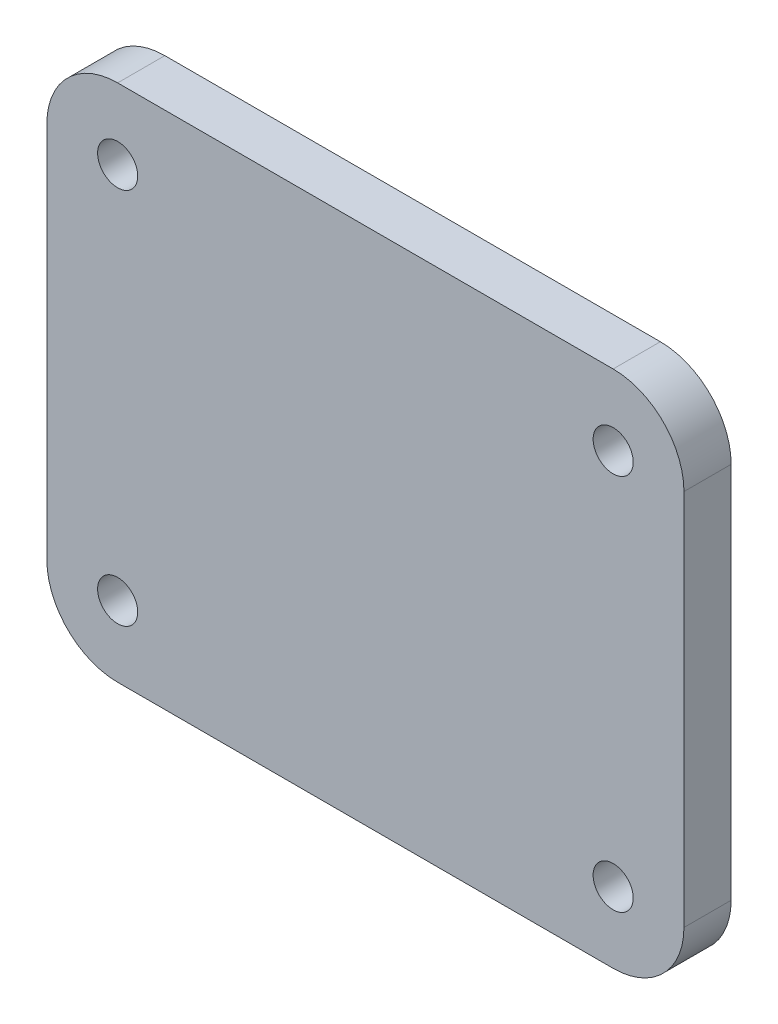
ISO-10303-21;
HEADER;
FILE_DESCRIPTION(('STEP AP214'),'2;1');
FILE_NAME('part.step','',(''),(''),'','','');
FILE_SCHEMA(('AUTOMOTIVE_DESIGN { 1 0 10303 214 1 1 1 1 }'));
ENDSEC;
DATA;
#1=APPLICATION_CONTEXT('core data for automotive mechanical design processes');
#2=APPLICATION_PROTOCOL_DEFINITION('international standard','automotive_design',2000,#1);
#3=PRODUCT_CONTEXT('',#1,'mechanical');
#4=PRODUCT('Part','Part','',(#3));
#5=PRODUCT_RELATED_PRODUCT_CATEGORY('part','',(#4));
#6=PRODUCT_DEFINITION_FORMATION('','',#4);
#7=PRODUCT_DEFINITION_CONTEXT('part definition',#1,'design');
#8=PRODUCT_DEFINITION('design','',#6,#7);
#9=PRODUCT_DEFINITION_SHAPE('','',#8);
#10=(LENGTH_UNIT() NAMED_UNIT(*) SI_UNIT(.MILLI.,.METRE.));
#11=(NAMED_UNIT(*) PLANE_ANGLE_UNIT() SI_UNIT($,.RADIAN.));
#12=(NAMED_UNIT(*) SI_UNIT($,.STERADIAN.) SOLID_ANGLE_UNIT());
#13=UNCERTAINTY_MEASURE_WITH_UNIT(LENGTH_MEASURE(1.E-05),#10,'distance_accuracy_value','');
#14=(GEOMETRIC_REPRESENTATION_CONTEXT(3) GLOBAL_UNCERTAINTY_ASSIGNED_CONTEXT((#13)) GLOBAL_UNIT_ASSIGNED_CONTEXT((#10,
#11,#12)) REPRESENTATION_CONTEXT('',''));
#15=CARTESIAN_POINT('',(0.,0.,0.));
#16=DIRECTION('',(0.,0.,1.));
#17=DIRECTION('',(1.,0.,0.));
#18=AXIS2_PLACEMENT_3D('',#15,#16,#17);
#19=CARTESIAN_POINT('',(-67.5,55.,10.));
#20=DIRECTION('',(1.,0.,0.));
#21=DIRECTION('',(0.,0.,-1.));
#22=AXIS2_PLACEMENT_3D('',#19,#20,#21);
#23=PLANE('',#22);
#24=DIRECTION('',(0.,-1.,0.));
#25=VECTOR('',#24,1.);
#26=CARTESIAN_POINT('',(-67.5,55.,0.));
#27=LINE('',#26,#25);
#28=CARTESIAN_POINT('',(-67.5,40.,0.));
#29=VERTEX_POINT('',#28);
#30=CARTESIAN_POINT('',(-67.5,-40.,0.));
#31=VERTEX_POINT('',#30);
#32=EDGE_CURVE('E132',#29,#31,#27,.T.);
#33=ORIENTED_EDGE('',*,*,#32,.T.);
#34=DIRECTION('',(0.,0.,-1.));
#35=VECTOR('',#34,1.);
#36=CARTESIAN_POINT('',(-67.5,-40.,10.));
#37=LINE('',#36,#35);
#38=CARTESIAN_POINT('',(-67.5,-40.,10.));
#39=VERTEX_POINT('',#38);
#40=EDGE_CURVE('E166',#31,#39,#37,.F.);
#41=ORIENTED_EDGE('',*,*,#40,.T.);
#42=DIRECTION('',(0.,-1.,0.));
#43=VECTOR('',#42,1.);
#44=CARTESIAN_POINT('',(-67.5,55.,10.));
#45=LINE('',#44,#43);
#46=CARTESIAN_POINT('',(-67.5,40.,10.));
#47=VERTEX_POINT('',#46);
#48=EDGE_CURVE('E130',#47,#39,#45,.T.);
#49=ORIENTED_EDGE('',*,*,#48,.F.);
#50=DIRECTION('',(0.,0.,-1.));
#51=VECTOR('',#50,1.);
#52=CARTESIAN_POINT('',(-67.5,40.,10.));
#53=LINE('',#52,#51);
#54=EDGE_CURVE('E163',#47,#29,#53,.T.);
#55=ORIENTED_EDGE('',*,*,#54,.T.);
#56=EDGE_LOOP('',(#33,#41,#49,#55));
#57=FACE_BOUND('',#56,.T.);
#58=ADVANCED_FACE('F34',(#57),#23,.F.);
#59=CARTESIAN_POINT('',(-67.5,-55.,10.));
#60=DIRECTION('',(0.,1.,0.));
#61=DIRECTION('',(-1.,0.,0.));
#62=AXIS2_PLACEMENT_3D('',#59,#60,#61);
#63=PLANE('',#62);
#64=DIRECTION('',(1.,0.,0.));
#65=VECTOR('',#64,1.);
#66=CARTESIAN_POINT('',(-67.5,-55.,0.));
#67=LINE('',#66,#65);
#68=CARTESIAN_POINT('',(-52.5,-55.,0.));
#69=VERTEX_POINT('',#68);
#70=CARTESIAN_POINT('',(52.5,-55.,0.));
#71=VERTEX_POINT('',#70);
#72=EDGE_CURVE('E128',#69,#71,#67,.T.);
#73=ORIENTED_EDGE('',*,*,#72,.T.);
#74=DIRECTION('',(0.,0.,-1.));
#75=VECTOR('',#74,1.);
#76=CARTESIAN_POINT('',(52.5,-55.,10.));
#77=LINE('',#76,#75);
#78=CARTESIAN_POINT('',(52.5,-55.,10.));
#79=VERTEX_POINT('',#78);
#80=EDGE_CURVE('E105',#71,#79,#77,.F.);
#81=ORIENTED_EDGE('',*,*,#80,.T.);
#82=DIRECTION('',(1.,0.,0.));
#83=VECTOR('',#82,1.);
#84=CARTESIAN_POINT('',(-67.5,-55.,10.));
#85=LINE('',#84,#83);
#86=CARTESIAN_POINT('',(-52.5,-55.,10.));
#87=VERTEX_POINT('',#86);
#88=EDGE_CURVE('E181',#87,#79,#85,.T.);
#89=ORIENTED_EDGE('',*,*,#88,.F.);
#90=DIRECTION('',(0.,0.,-1.));
#91=VECTOR('',#90,1.);
#92=CARTESIAN_POINT('',(-52.5,-55.,10.));
#93=LINE('',#92,#91);
#94=EDGE_CURVE('E110',#87,#69,#93,.T.);
#95=ORIENTED_EDGE('',*,*,#94,.T.);
#96=EDGE_LOOP('',(#73,#81,#89,#95));
#97=FACE_BOUND('',#96,.T.);
#98=ADVANCED_FACE('F186',(#97),#63,.F.);
#99=CARTESIAN_POINT('',(67.5,55.,10.));
#100=DIRECTION('',(-1.,0.,0.));
#101=DIRECTION('',(0.,0.,1.));
#102=AXIS2_PLACEMENT_3D('',#99,#100,#101);
#103=PLANE('',#102);
#104=DIRECTION('',(0.,1.,0.));
#105=VECTOR('',#104,1.);
#106=CARTESIAN_POINT('',(67.5,55.,10.));
#107=LINE('',#106,#105);
#108=CARTESIAN_POINT('',(67.5,-40.,10.));
#109=VERTEX_POINT('',#108);
#110=CARTESIAN_POINT('',(67.5,40.,10.));
#111=VERTEX_POINT('',#110);
#112=EDGE_CURVE('E119',#109,#111,#107,.T.);
#113=ORIENTED_EDGE('',*,*,#112,.F.);
#114=DIRECTION('',(0.,0.,-1.));
#115=VECTOR('',#114,1.);
#116=CARTESIAN_POINT('',(67.5,-40.,10.));
#117=LINE('',#116,#115);
#118=CARTESIAN_POINT('',(67.5,-40.,0.));
#119=VERTEX_POINT('',#118);
#120=EDGE_CURVE('E104',#109,#119,#117,.T.);
#121=ORIENTED_EDGE('',*,*,#120,.T.);
#122=DIRECTION('',(0.,1.,0.));
#123=VECTOR('',#122,1.);
#124=CARTESIAN_POINT('',(67.5,55.,0.));
#125=LINE('',#124,#123);
#126=CARTESIAN_POINT('',(67.5,40.,0.));
#127=VERTEX_POINT('',#126);
#128=EDGE_CURVE('E117',#119,#127,#125,.T.);
#129=ORIENTED_EDGE('',*,*,#128,.T.);
#130=DIRECTION('',(0.,0.,-1.));
#131=VECTOR('',#130,1.);
#132=CARTESIAN_POINT('',(67.5,40.,10.));
#133=LINE('',#132,#131);
#134=EDGE_CURVE('E121',#127,#111,#133,.F.);
#135=ORIENTED_EDGE('',*,*,#134,.T.);
#136=EDGE_LOOP('',(#113,#121,#129,#135));
#137=FACE_BOUND('',#136,.T.);
#138=ADVANCED_FACE('F116',(#137),#103,.F.);
#139=CARTESIAN_POINT('',(-67.5,55.,10.));
#140=DIRECTION('',(0.,-1.,0.));
#141=DIRECTION('',(0.,0.,-1.));
#142=AXIS2_PLACEMENT_3D('',#139,#140,#141);
#143=PLANE('',#142);
#144=DIRECTION('',(-1.,0.,0.));
#145=VECTOR('',#144,1.);
#146=CARTESIAN_POINT('',(-67.5,55.,10.));
#147=LINE('',#146,#145);
#148=CARTESIAN_POINT('',(52.5,55.,10.));
#149=VERTEX_POINT('',#148);
#150=CARTESIAN_POINT('',(-52.5,55.,10.));
#151=VERTEX_POINT('',#150);
#152=EDGE_CURVE('E140',#149,#151,#147,.T.);
#153=ORIENTED_EDGE('',*,*,#152,.F.);
#154=DIRECTION('',(0.,0.,-1.));
#155=VECTOR('',#154,1.);
#156=CARTESIAN_POINT('',(52.5,55.,10.));
#157=LINE('',#156,#155);
#158=CARTESIAN_POINT('',(52.5,55.,0.));
#159=VERTEX_POINT('',#158);
#160=EDGE_CURVE('E11',#149,#159,#157,.T.);
#161=ORIENTED_EDGE('',*,*,#160,.T.);
#162=DIRECTION('',(-1.,0.,0.));
#163=VECTOR('',#162,1.);
#164=CARTESIAN_POINT('',(-67.5,55.,0.));
#165=LINE('',#164,#163);
#166=CARTESIAN_POINT('',(-52.5,55.,0.));
#167=VERTEX_POINT('',#166);
#168=EDGE_CURVE('E127',#159,#167,#165,.T.);
#169=ORIENTED_EDGE('',*,*,#168,.T.);
#170=DIRECTION('',(0.,0.,-1.));
#171=VECTOR('',#170,1.);
#172=CARTESIAN_POINT('',(-52.5,55.,10.));
#173=LINE('',#172,#171);
#174=EDGE_CURVE('E42',#167,#151,#173,.F.);
#175=ORIENTED_EDGE('',*,*,#174,.T.);
#176=EDGE_LOOP('',(#153,#161,#169,#175));
#177=FACE_BOUND('',#176,.T.);
#178=ADVANCED_FACE('F216',(#177),#143,.F.);
#179=CARTESIAN_POINT('',(0.,0.,10.));
#180=DIRECTION('',(0.,0.,1.));
#181=DIRECTION('',(1.,0.,0.));
#182=AXIS2_PLACEMENT_3D('',#179,#180,#181);
#183=PLANE('',#182);
#184=CARTESIAN_POINT('',(52.5,40.,10.));
#185=DIRECTION('',(0.,0.,1.));
#186=DIRECTION('',(1.,0.,0.));
#187=AXIS2_PLACEMENT_3D('',#184,#185,#186);
#188=CIRCLE('',#187,4.24999999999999);
#189=CARTESIAN_POINT('',(56.75,40.,10.));
#190=VERTEX_POINT('',#189);
#191=EDGE_CURVE('E197',#190,#190,#188,.T.);
#192=ORIENTED_EDGE('',*,*,#191,.F.);
#193=EDGE_LOOP('',(#192));
#194=FACE_BOUND('',#193,.T.);
#195=CARTESIAN_POINT('',(-52.5,40.,10.));
#196=DIRECTION('',(0.,0.,1.));
#197=DIRECTION('',(1.,0.,0.));
#198=AXIS2_PLACEMENT_3D('',#195,#196,#197);
#199=CIRCLE('',#198,4.24999999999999);
#200=CARTESIAN_POINT('',(-48.25,40.,10.));
#201=VERTEX_POINT('',#200);
#202=EDGE_CURVE('E189',#201,#201,#199,.T.);
#203=ORIENTED_EDGE('',*,*,#202,.F.);
#204=EDGE_LOOP('',(#203));
#205=FACE_BOUND('',#204,.T.);
#206=ORIENTED_EDGE('',*,*,#88,.T.);
#207=CARTESIAN_POINT('',(52.5,-40.,10.));
#208=DIRECTION('',(0.,0.,1.));
#209=DIRECTION('',(1.,0.,0.));
#210=AXIS2_PLACEMENT_3D('',#207,#208,#209);
#211=CIRCLE('',#210,15.);
#212=EDGE_CURVE('E161',#79,#109,#211,.T.);
#213=ORIENTED_EDGE('',*,*,#212,.T.);
#214=ORIENTED_EDGE('',*,*,#112,.T.);
#215=CARTESIAN_POINT('',(52.5,40.,10.));
#216=DIRECTION('',(0.,0.,1.));
#217=DIRECTION('',(1.,0.,0.));
#218=AXIS2_PLACEMENT_3D('',#215,#216,#217);
#219=CIRCLE('',#218,15.);
#220=EDGE_CURVE('E55',#111,#149,#219,.T.);
#221=ORIENTED_EDGE('',*,*,#220,.T.);
#222=ORIENTED_EDGE('',*,*,#152,.T.);
#223=CARTESIAN_POINT('',(-52.5,40.,10.));
#224=DIRECTION('',(0.,0.,1.));
#225=DIRECTION('',(1.,0.,0.));
#226=AXIS2_PLACEMENT_3D('',#223,#224,#225);
#227=CIRCLE('',#226,15.);
#228=EDGE_CURVE('E156',#151,#47,#227,.T.);
#229=ORIENTED_EDGE('',*,*,#228,.T.);
#230=ORIENTED_EDGE('',*,*,#48,.T.);
#231=CARTESIAN_POINT('',(-52.5,-40.,10.));
#232=DIRECTION('',(0.,0.,1.));
#233=DIRECTION('',(1.,0.,0.));
#234=AXIS2_PLACEMENT_3D('',#231,#232,#233);
#235=CIRCLE('',#234,15.);
#236=EDGE_CURVE('E159',#39,#87,#235,.T.);
#237=ORIENTED_EDGE('',*,*,#236,.T.);
#238=EDGE_LOOP('',(#206,#213,#214,#221,#222,#229,#230,#237));
#239=FACE_BOUND('',#238,.T.);
#240=CARTESIAN_POINT('',(-52.5,-40.,10.));
#241=DIRECTION('',(0.,0.,1.));
#242=DIRECTION('',(1.,0.,0.));
#243=AXIS2_PLACEMENT_3D('',#240,#241,#242);
#244=CIRCLE('',#243,4.24999999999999);
#245=CARTESIAN_POINT('',(-48.25,-40.,10.));
#246=VERTEX_POINT('',#245);
#247=EDGE_CURVE('E139',#246,#246,#244,.T.);
#248=ORIENTED_EDGE('',*,*,#247,.F.);
#249=EDGE_LOOP('',(#248));
#250=FACE_BOUND('',#249,.T.);
#251=CARTESIAN_POINT('',(52.5,-40.,10.));
#252=DIRECTION('',(0.,0.,1.));
#253=DIRECTION('',(1.,0.,0.));
#254=AXIS2_PLACEMENT_3D('',#251,#252,#253);
#255=CIRCLE('',#254,4.24999999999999);
#256=CARTESIAN_POINT('',(56.75,-40.,10.));
#257=VERTEX_POINT('',#256);
#258=EDGE_CURVE('E146',#257,#257,#255,.T.);
#259=ORIENTED_EDGE('',*,*,#258,.F.);
#260=EDGE_LOOP('',(#259));
#261=FACE_BOUND('',#260,.T.);
#262=ADVANCED_FACE('F177',(#194,#205,#239,#250,#261),#183,.T.);
#263=CARTESIAN_POINT('',(0.,0.,0.));
#264=DIRECTION('',(0.,0.,1.));
#265=DIRECTION('',(1.,0.,0.));
#266=AXIS2_PLACEMENT_3D('',#263,#264,#265);
#267=PLANE('',#266);
#268=CARTESIAN_POINT('',(52.5,40.,0.));
#269=DIRECTION('',(0.,0.,1.));
#270=DIRECTION('',(1.,0.,0.));
#271=AXIS2_PLACEMENT_3D('',#268,#269,#270);
#272=CIRCLE('',#271,4.25);
#273=CARTESIAN_POINT('',(56.75,40.,0.));
#274=VERTEX_POINT('',#273);
#275=EDGE_CURVE('E200',#274,#274,#272,.T.);
#276=ORIENTED_EDGE('',*,*,#275,.T.);
#277=EDGE_LOOP('',(#276));
#278=FACE_BOUND('',#277,.T.);
#279=CARTESIAN_POINT('',(-52.5,40.,0.));
#280=DIRECTION('',(0.,0.,1.));
#281=DIRECTION('',(1.,0.,0.));
#282=AXIS2_PLACEMENT_3D('',#279,#280,#281);
#283=CIRCLE('',#282,4.25);
#284=CARTESIAN_POINT('',(-48.25,40.,0.));
#285=VERTEX_POINT('',#284);
#286=EDGE_CURVE('E187',#285,#285,#283,.T.);
#287=ORIENTED_EDGE('',*,*,#286,.T.);
#288=EDGE_LOOP('',(#287));
#289=FACE_BOUND('',#288,.T.);
#290=ORIENTED_EDGE('',*,*,#128,.F.);
#291=CARTESIAN_POINT('',(52.5,-40.,0.));
#292=DIRECTION('',(0.,0.,1.));
#293=DIRECTION('',(1.,0.,0.));
#294=AXIS2_PLACEMENT_3D('',#291,#292,#293);
#295=CIRCLE('',#294,15.);
#296=EDGE_CURVE('E100',#119,#71,#295,.F.);
#297=ORIENTED_EDGE('',*,*,#296,.T.);
#298=ORIENTED_EDGE('',*,*,#72,.F.);
#299=CARTESIAN_POINT('',(-52.5,-40.,0.));
#300=DIRECTION('',(0.,0.,1.));
#301=DIRECTION('',(1.,0.,0.));
#302=AXIS2_PLACEMENT_3D('',#299,#300,#301);
#303=CIRCLE('',#302,15.);
#304=EDGE_CURVE('E111',#69,#31,#303,.F.);
#305=ORIENTED_EDGE('',*,*,#304,.T.);
#306=ORIENTED_EDGE('',*,*,#32,.F.);
#307=CARTESIAN_POINT('',(-52.5,40.,0.));
#308=DIRECTION('',(0.,0.,1.));
#309=DIRECTION('',(1.,0.,0.));
#310=AXIS2_PLACEMENT_3D('',#307,#308,#309);
#311=CIRCLE('',#310,15.);
#312=EDGE_CURVE('E120',#29,#167,#311,.F.);
#313=ORIENTED_EDGE('',*,*,#312,.T.);
#314=ORIENTED_EDGE('',*,*,#168,.F.);
#315=CARTESIAN_POINT('',(52.5,40.,0.));
#316=DIRECTION('',(0.,0.,1.));
#317=DIRECTION('',(1.,0.,0.));
#318=AXIS2_PLACEMENT_3D('',#315,#316,#317);
#319=CIRCLE('',#318,15.);
#320=EDGE_CURVE('E126',#159,#127,#319,.F.);
#321=ORIENTED_EDGE('',*,*,#320,.T.);
#322=EDGE_LOOP('',(#290,#297,#298,#305,#306,#313,#314,#321));
#323=FACE_BOUND('',#322,.T.);
#324=CARTESIAN_POINT('',(-52.5,-40.,0.));
#325=DIRECTION('',(0.,0.,1.));
#326=DIRECTION('',(1.,0.,0.));
#327=AXIS2_PLACEMENT_3D('',#324,#325,#326);
#328=CIRCLE('',#327,4.25);
#329=CARTESIAN_POINT('',(-48.25,-40.,0.));
#330=VERTEX_POINT('',#329);
#331=EDGE_CURVE('E136',#330,#330,#328,.T.);
#332=ORIENTED_EDGE('',*,*,#331,.T.);
#333=EDGE_LOOP('',(#332));
#334=FACE_BOUND('',#333,.T.);
#335=CARTESIAN_POINT('',(52.5,-40.,0.));
#336=DIRECTION('',(0.,0.,1.));
#337=DIRECTION('',(1.,0.,0.));
#338=AXIS2_PLACEMENT_3D('',#335,#336,#337);
#339=CIRCLE('',#338,4.25);
#340=CARTESIAN_POINT('',(56.75,-40.,0.));
#341=VERTEX_POINT('',#340);
#342=EDGE_CURVE('E143',#341,#341,#339,.T.);
#343=ORIENTED_EDGE('',*,*,#342,.T.);
#344=EDGE_LOOP('',(#343));
#345=FACE_BOUND('',#344,.T.);
#346=ADVANCED_FACE('F123',(#278,#289,#323,#334,#345),#267,.F.);
#347=CARTESIAN_POINT('',(-52.5,40.,10.));
#348=DIRECTION('',(0.,0.,1.));
#349=DIRECTION('',(1.,0.,0.));
#350=AXIS2_PLACEMENT_3D('',#347,#348,#349);
#351=CYLINDRICAL_SURFACE('',#350,4.24999999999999);
#352=ORIENTED_EDGE('',*,*,#286,.F.);
#353=EDGE_LOOP('',(#352));
#354=FACE_BOUND('',#353,.T.);
#355=ORIENTED_EDGE('',*,*,#202,.T.);
#356=EDGE_LOOP('',(#355));
#357=FACE_BOUND('',#356,.T.);
#358=ADVANCED_FACE('F210',(#354,#357),#351,.F.);
#359=CARTESIAN_POINT('',(52.5,40.,10.));
#360=DIRECTION('',(0.,0.,1.));
#361=DIRECTION('',(1.,0.,0.));
#362=AXIS2_PLACEMENT_3D('',#359,#360,#361);
#363=CYLINDRICAL_SURFACE('',#362,4.24999999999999);
#364=ORIENTED_EDGE('',*,*,#275,.F.);
#365=EDGE_LOOP('',(#364));
#366=FACE_BOUND('',#365,.T.);
#367=ORIENTED_EDGE('',*,*,#191,.T.);
#368=EDGE_LOOP('',(#367));
#369=FACE_BOUND('',#368,.T.);
#370=ADVANCED_FACE('F206',(#366,#369),#363,.F.);
#371=CARTESIAN_POINT('',(-52.5,-40.,10.));
#372=DIRECTION('',(0.,0.,1.));
#373=DIRECTION('',(1.,0.,0.));
#374=AXIS2_PLACEMENT_3D('',#371,#372,#373);
#375=CYLINDRICAL_SURFACE('',#374,4.24999999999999);
#376=ORIENTED_EDGE('',*,*,#331,.F.);
#377=EDGE_LOOP('',(#376));
#378=FACE_BOUND('',#377,.T.);
#379=ORIENTED_EDGE('',*,*,#247,.T.);
#380=EDGE_LOOP('',(#379));
#381=FACE_BOUND('',#380,.T.);
#382=ADVANCED_FACE('F209',(#378,#381),#375,.F.);
#383=CARTESIAN_POINT('',(52.5,-40.,10.));
#384=DIRECTION('',(0.,0.,1.));
#385=DIRECTION('',(1.,0.,0.));
#386=AXIS2_PLACEMENT_3D('',#383,#384,#385);
#387=CYLINDRICAL_SURFACE('',#386,4.24999999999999);
#388=ORIENTED_EDGE('',*,*,#342,.F.);
#389=EDGE_LOOP('',(#388));
#390=FACE_BOUND('',#389,.T.);
#391=ORIENTED_EDGE('',*,*,#258,.T.);
#392=EDGE_LOOP('',(#391));
#393=FACE_BOUND('',#392,.T.);
#394=ADVANCED_FACE('F238',(#390,#393),#387,.F.);
#395=CARTESIAN_POINT('',(52.5,-40.,10.));
#396=DIRECTION('',(0.,0.,-1.));
#397=DIRECTION('',(-1.,0.,0.));
#398=AXIS2_PLACEMENT_3D('',#395,#396,#397);
#399=CYLINDRICAL_SURFACE('',#398,15.);
#400=ORIENTED_EDGE('',*,*,#212,.F.);
#401=ORIENTED_EDGE('',*,*,#80,.F.);
#402=ORIENTED_EDGE('',*,*,#296,.F.);
#403=ORIENTED_EDGE('',*,*,#120,.F.);
#404=EDGE_LOOP('',(#400,#401,#402,#403));
#405=FACE_BOUND('',#404,.T.);
#406=ADVANCED_FACE('F103',(#405),#399,.T.);
#407=CARTESIAN_POINT('',(-52.5,-40.,10.));
#408=DIRECTION('',(0.,0.,-1.));
#409=DIRECTION('',(-1.,0.,0.));
#410=AXIS2_PLACEMENT_3D('',#407,#408,#409);
#411=CYLINDRICAL_SURFACE('',#410,15.);
#412=ORIENTED_EDGE('',*,*,#236,.F.);
#413=ORIENTED_EDGE('',*,*,#40,.F.);
#414=ORIENTED_EDGE('',*,*,#304,.F.);
#415=ORIENTED_EDGE('',*,*,#94,.F.);
#416=EDGE_LOOP('',(#412,#413,#414,#415));
#417=FACE_BOUND('',#416,.T.);
#418=ADVANCED_FACE('F184',(#417),#411,.T.);
#419=CARTESIAN_POINT('',(52.5,40.,10.));
#420=DIRECTION('',(0.,0.,-1.));
#421=DIRECTION('',(-1.,0.,0.));
#422=AXIS2_PLACEMENT_3D('',#419,#420,#421);
#423=CYLINDRICAL_SURFACE('',#422,15.);
#424=ORIENTED_EDGE('',*,*,#220,.F.);
#425=ORIENTED_EDGE('',*,*,#134,.F.);
#426=ORIENTED_EDGE('',*,*,#320,.F.);
#427=ORIENTED_EDGE('',*,*,#160,.F.);
#428=EDGE_LOOP('',(#424,#425,#426,#427));
#429=FACE_BOUND('',#428,.T.);
#430=ADVANCED_FACE('F246',(#429),#423,.T.);
#431=CARTESIAN_POINT('',(-52.5,40.,10.));
#432=DIRECTION('',(0.,0.,-1.));
#433=DIRECTION('',(-1.,0.,0.));
#434=AXIS2_PLACEMENT_3D('',#431,#432,#433);
#435=CYLINDRICAL_SURFACE('',#434,15.);
#436=ORIENTED_EDGE('',*,*,#228,.F.);
#437=ORIENTED_EDGE('',*,*,#174,.F.);
#438=ORIENTED_EDGE('',*,*,#312,.F.);
#439=ORIENTED_EDGE('',*,*,#54,.F.);
#440=EDGE_LOOP('',(#436,#437,#438,#439));
#441=FACE_BOUND('',#440,.T.);
#442=ADVANCED_FACE('F36',(#441),#435,.T.);
#443=CLOSED_SHELL('',(#58,#98,#138,#178,#262,#346,#358,#370,#382,#394,#406,#418,#430,#442));
#444=MANIFOLD_SOLID_BREP('B2',#443);
#445=ADVANCED_BREP_SHAPE_REPRESENTATION('',(#18,#444),#14);
#446=SHAPE_DEFINITION_REPRESENTATION(#9,#445);
ENDSEC;
END-ISO-10303-21;
